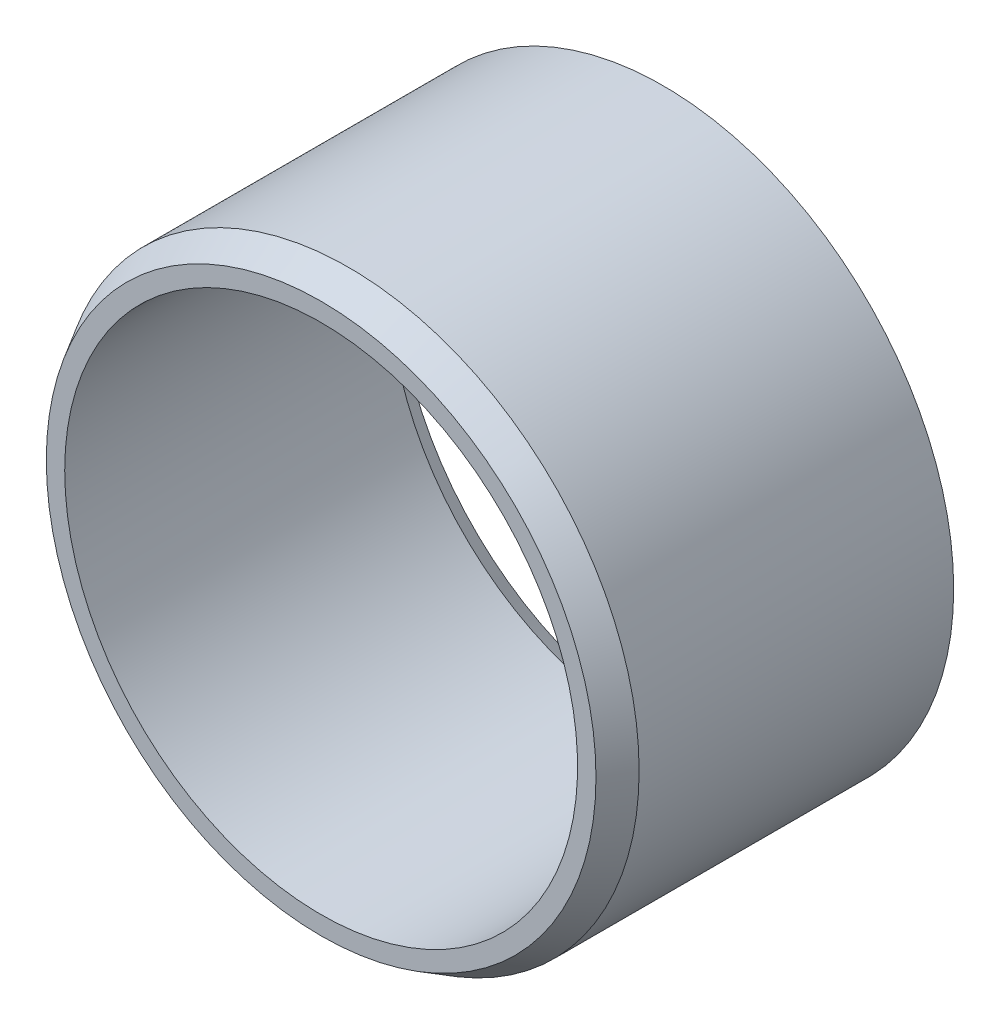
ISO-10303-21;
HEADER;
FILE_DESCRIPTION(('STEP AP214'),'2;1');
FILE_NAME('part.step','',(''),(''),'','','');
FILE_SCHEMA(('AUTOMOTIVE_DESIGN { 1 0 10303 214 1 1 1 1 }'));
ENDSEC;
DATA;
#1=APPLICATION_CONTEXT('core data for automotive mechanical design processes');
#2=APPLICATION_PROTOCOL_DEFINITION('international standard','automotive_design',2000,#1);
#3=PRODUCT_CONTEXT('',#1,'mechanical');
#4=PRODUCT('Part','Part','',(#3));
#5=PRODUCT_RELATED_PRODUCT_CATEGORY('part','',(#4));
#6=PRODUCT_DEFINITION_FORMATION('','',#4);
#7=PRODUCT_DEFINITION_CONTEXT('part definition',#1,'design');
#8=PRODUCT_DEFINITION('design','',#6,#7);
#9=PRODUCT_DEFINITION_SHAPE('','',#8);
#10=(LENGTH_UNIT() NAMED_UNIT(*) SI_UNIT(.MILLI.,.METRE.));
#11=(NAMED_UNIT(*) PLANE_ANGLE_UNIT() SI_UNIT($,.RADIAN.));
#12=(NAMED_UNIT(*) SI_UNIT($,.STERADIAN.) SOLID_ANGLE_UNIT());
#13=UNCERTAINTY_MEASURE_WITH_UNIT(LENGTH_MEASURE(1.E-05),#10,'distance_accuracy_value','');
#14=(GEOMETRIC_REPRESENTATION_CONTEXT(3) GLOBAL_UNCERTAINTY_ASSIGNED_CONTEXT((#13)) GLOBAL_UNIT_ASSIGNED_CONTEXT((#10,
#11,#12)) REPRESENTATION_CONTEXT('',''));
#15=CARTESIAN_POINT('',(0.,0.,0.));
#16=DIRECTION('',(0.,0.,1.));
#17=DIRECTION('',(1.,0.,0.));
#18=AXIS2_PLACEMENT_3D('',#15,#16,#17);
#19=CARTESIAN_POINT('',(0.,0.,0.));
#20=DIRECTION('',(0.,0.,-1.));
#21=DIRECTION('',(-1.,0.,0.));
#22=AXIS2_PLACEMENT_3D('',#19,#20,#21);
#23=CYLINDRICAL_SURFACE('',#22,7.5);
#24=CARTESIAN_POINT('',(0.,0.,22.3220338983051));
#25=DIRECTION('',(0.,0.,-1.));
#26=DIRECTION('',(-1.,0.,0.));
#27=AXIS2_PLACEMENT_3D('',#24,#25,#26);
#28=CIRCLE('',#27,7.5);
#29=CARTESIAN_POINT('',(-7.5,0.,22.3220338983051));
#30=VERTEX_POINT('',#29);
#31=EDGE_CURVE('E45',#30,#30,#28,.T.);
#32=ORIENTED_EDGE('',*,*,#31,.T.);
#33=EDGE_LOOP('',(#32));
#34=FACE_BOUND('',#33,.T.);
#35=CARTESIAN_POINT('',(0.,0.,31.8220338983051));
#36=DIRECTION('',(0.,0.,-1.));
#37=DIRECTION('',(-1.,0.,0.));
#38=AXIS2_PLACEMENT_3D('',#35,#36,#37);
#39=CIRCLE('',#38,7.5);
#40=CARTESIAN_POINT('',(-7.5,0.,31.8220338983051));
#41=VERTEX_POINT('',#40);
#42=EDGE_CURVE('E53',#41,#41,#39,.T.);
#43=ORIENTED_EDGE('',*,*,#42,.F.);
#44=EDGE_LOOP('',(#43));
#45=FACE_BOUND('',#44,.T.);
#46=ADVANCED_FACE('F30',(#34,#45),#23,.F.);
#47=CARTESIAN_POINT('',(0.,7.5,21.8220338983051));
#48=DIRECTION('',(0.,0.,-1.));
#49=DIRECTION('',(-1.,0.,0.));
#50=AXIS2_PLACEMENT_3D('',#47,#48,#49);
#51=PLANE('',#50);
#52=CARTESIAN_POINT('',(0.,0.,21.8220338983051));
#53=DIRECTION('',(0.,0.,-1.));
#54=DIRECTION('',(-1.,0.,0.));
#55=AXIS2_PLACEMENT_3D('',#52,#53,#54);
#56=CIRCLE('',#55,7.7886751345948);
#57=CARTESIAN_POINT('',(-7.7886751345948,0.,21.8220338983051));
#58=VERTEX_POINT('',#57);
#59=EDGE_CURVE('E41',#58,#58,#56,.F.);
#60=ORIENTED_EDGE('',*,*,#59,.T.);
#61=EDGE_LOOP('',(#60));
#62=FACE_BOUND('',#61,.T.);
#63=CARTESIAN_POINT('',(0.,0.,21.8220338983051));
#64=DIRECTION('',(0.,0.,-1.));
#65=DIRECTION('',(-1.,0.,0.));
#66=AXIS2_PLACEMENT_3D('',#63,#64,#65);
#67=CIRCLE('',#66,8.5);
#68=CARTESIAN_POINT('',(-8.5,0.,21.8220338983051));
#69=VERTEX_POINT('',#68);
#70=EDGE_CURVE('E50',#69,#69,#67,.T.);
#71=ORIENTED_EDGE('',*,*,#70,.T.);
#72=EDGE_LOOP('',(#71));
#73=FACE_BOUND('',#72,.T.);
#74=ADVANCED_FACE('F60',(#62,#73),#51,.T.);
#75=CARTESIAN_POINT('',(0.,0.,0.));
#76=DIRECTION('',(0.,0.,-1.));
#77=DIRECTION('',(-1.,0.,0.));
#78=AXIS2_PLACEMENT_3D('',#75,#76,#77);
#79=CYLINDRICAL_SURFACE('',#78,8.5);
#80=CARTESIAN_POINT('',(0.,0.,31.0220338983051));
#81=DIRECTION('',(0.,0.,1.));
#82=DIRECTION('',(1.,0.,0.));
#83=AXIS2_PLACEMENT_3D('',#80,#81,#82);
#84=CIRCLE('',#83,8.5);
#85=CARTESIAN_POINT('',(8.5,0.,31.0220338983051));
#86=VERTEX_POINT('',#85);
#87=EDGE_CURVE('E37',#86,#86,#84,.F.);
#88=ORIENTED_EDGE('',*,*,#87,.T.);
#89=EDGE_LOOP('',(#88));
#90=FACE_BOUND('',#89,.T.);
#91=ORIENTED_EDGE('',*,*,#70,.F.);
#92=EDGE_LOOP('',(#91));
#93=FACE_BOUND('',#92,.T.);
#94=ADVANCED_FACE('F66',(#90,#93),#79,.T.);
#95=CARTESIAN_POINT('',(0.,7.5,31.8220338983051));
#96=DIRECTION('',(0.,0.,1.));
#97=DIRECTION('',(1.,0.,0.));
#98=AXIS2_PLACEMENT_3D('',#95,#96,#97);
#99=PLANE('',#98);
#100=CARTESIAN_POINT('',(0.,0.,31.8220338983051));
#101=DIRECTION('',(0.,0.,1.));
#102=DIRECTION('',(1.,0.,0.));
#103=AXIS2_PLACEMENT_3D('',#100,#101,#102);
#104=CIRCLE('',#103,8.0381197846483);
#105=CARTESIAN_POINT('',(8.0381197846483,0.,31.8220338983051));
#106=VERTEX_POINT('',#105);
#107=EDGE_CURVE('E10',#106,#106,#104,.T.);
#108=ORIENTED_EDGE('',*,*,#107,.T.);
#109=EDGE_LOOP('',(#108));
#110=FACE_BOUND('',#109,.T.);
#111=ORIENTED_EDGE('',*,*,#42,.T.);
#112=EDGE_LOOP('',(#111));
#113=FACE_BOUND('',#112,.T.);
#114=ADVANCED_FACE('F57',(#110,#113),#99,.T.);
#115=CARTESIAN_POINT('',(0.,0.,22.3220338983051));
#116=DIRECTION('',(0.,0.,-1.));
#117=DIRECTION('',(-1.,0.,0.));
#118=AXIS2_PLACEMENT_3D('',#115,#116,#117);
#119=CONICAL_SURFACE('',#118,7.5,0.523598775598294);
#120=ORIENTED_EDGE('',*,*,#59,.F.);
#121=EDGE_LOOP('',(#120));
#122=FACE_BOUND('',#121,.T.);
#123=ORIENTED_EDGE('',*,*,#31,.F.);
#124=EDGE_LOOP('',(#123));
#125=FACE_BOUND('',#124,.T.);
#126=ADVANCED_FACE('F70',(#122,#125),#119,.F.);
#127=CARTESIAN_POINT('',(0.,0.,31.0220338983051));
#128=DIRECTION('',(0.,0.,-1.));
#129=DIRECTION('',(-1.,0.,0.));
#130=AXIS2_PLACEMENT_3D('',#127,#128,#129);
#131=CONICAL_SURFACE('',#130,8.5,0.523598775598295);
#132=ORIENTED_EDGE('',*,*,#107,.F.);
#133=EDGE_LOOP('',(#132));
#134=FACE_BOUND('',#133,.T.);
#135=ORIENTED_EDGE('',*,*,#87,.F.);
#136=EDGE_LOOP('',(#135));
#137=FACE_BOUND('',#136,.T.);
#138=ADVANCED_FACE('F32',(#134,#137),#131,.T.);
#139=CLOSED_SHELL('',(#46,#74,#94,#114,#126,#138));
#140=MANIFOLD_SOLID_BREP('B2',#139);
#141=ADVANCED_BREP_SHAPE_REPRESENTATION('',(#18,#140),#14);
#142=SHAPE_DEFINITION_REPRESENTATION(#9,#141);
ENDSEC;
END-ISO-10303-21;
